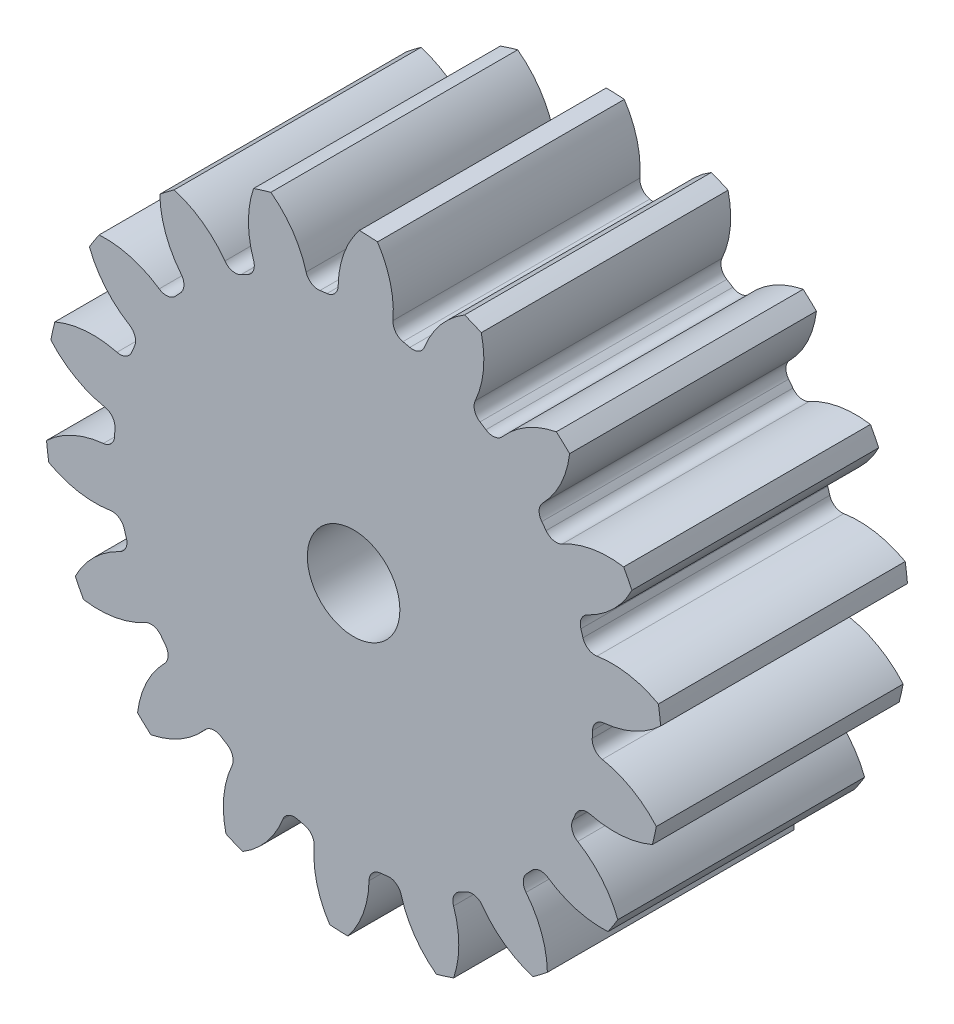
from build123d import *

# Parameters (mm, degrees)
SKETCH3_R         = 127
GEARBODY_DEPTH    = 101.6
TOOTHCUT_DEPTH    = 207.350575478
CIRPATTERN1_COUNT = 18
BOREDIA_R         = 19.05
BORE_DEPTH        = 12700


with BuildPart() as part:
    # Sketch3 → gearBody (new body)
    with BuildSketch(Plane.XY):
        Circle(SKETCH3_R)
    extrude(amount=GEARBODY_DEPTH)

    # Sketch2 → toothCut (cut, through all)
    with BuildSketch(Plane.XY):
        with BuildLine():
            ThreePointArc((98.229444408, -6.20136084), (98.310529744, -4.745562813), (98.370040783, -3.288723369))
            ThreePointArc((98.370040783, -3.288723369), (99.767995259, 0.076821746), (103.039036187, 1.683514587))
            ThreePointArc((103.039036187, 1.683514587), (115.980461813, 5.21635299), (127, 12.866923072))
            ThreePointArc((127, 12.866923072), (127.501678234, -6.154653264), (125.1702146, -25.03947057))
            ThreePointArc((125.1702146, -25.03947057), (114.938797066, -16.363092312), (102.397816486, -11.600188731))
            ThreePointArc((102.397816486, -11.600188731), (99.296737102, -9.685906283), (98.229444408, -6.20136084))
        make_face()
    toothcut = extrude(amount=TOOTHCUT_DEPTH, mode=Mode.SUBTRACT)

    # CirPattern1: toothCut ×18 about axis
    cirpattern1_axis = Axis((0, 0, 0), (0, 0, 1))
    for i in range(1, CIRPATTERN1_COUNT):
        add(toothcut.rotate(cirpattern1_axis, i * 360 / CIRPATTERN1_COUNT), mode=Mode.SUBTRACT)

    # boreDia → bore (cut, symmetric)
    with BuildSketch(Plane.XY):
        Circle(BOREDIA_R)
    extrude(amount=BORE_DEPTH, both=True, mode=Mode.SUBTRACT)


solid = part.part
